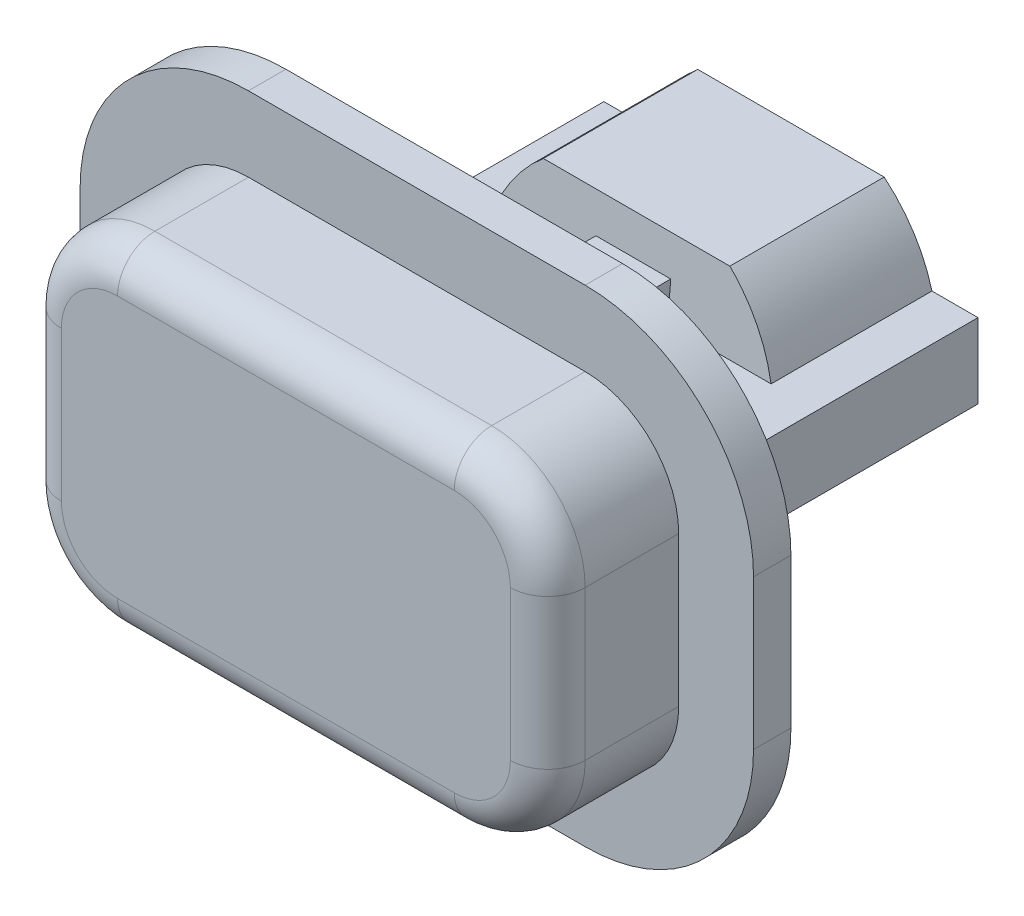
ISO-10303-21;
HEADER;
FILE_DESCRIPTION(('STEP AP214'),'2;1');
FILE_NAME('part.step','',(''),(''),'','','');
FILE_SCHEMA(('AUTOMOTIVE_DESIGN { 1 0 10303 214 1 1 1 1 }'));
ENDSEC;
DATA;
#1=APPLICATION_CONTEXT('core data for automotive mechanical design processes');
#2=APPLICATION_PROTOCOL_DEFINITION('international standard','automotive_design',2000,#1);
#3=PRODUCT_CONTEXT('',#1,'mechanical');
#4=PRODUCT('Part','Part','',(#3));
#5=PRODUCT_RELATED_PRODUCT_CATEGORY('part','',(#4));
#6=PRODUCT_DEFINITION_FORMATION('','',#4);
#7=PRODUCT_DEFINITION_CONTEXT('part definition',#1,'design');
#8=PRODUCT_DEFINITION('design','',#6,#7);
#9=PRODUCT_DEFINITION_SHAPE('','',#8);
#10=(LENGTH_UNIT() NAMED_UNIT(*) SI_UNIT(.MILLI.,.METRE.));
#11=(NAMED_UNIT(*) PLANE_ANGLE_UNIT() SI_UNIT($,.RADIAN.));
#12=(NAMED_UNIT(*) SI_UNIT($,.STERADIAN.) SOLID_ANGLE_UNIT());
#13=UNCERTAINTY_MEASURE_WITH_UNIT(LENGTH_MEASURE(1.E-05),#10,'distance_accuracy_value','');
#14=(GEOMETRIC_REPRESENTATION_CONTEXT(3) GLOBAL_UNCERTAINTY_ASSIGNED_CONTEXT((#13)) GLOBAL_UNIT_ASSIGNED_CONTEXT((#10,
#11,#12)) REPRESENTATION_CONTEXT('',''));
#15=CARTESIAN_POINT('',(0.,0.,0.));
#16=DIRECTION('',(0.,0.,1.));
#17=DIRECTION('',(1.,0.,0.));
#18=AXIS2_PLACEMENT_3D('',#15,#16,#17);
#19=CARTESIAN_POINT('',(0.,0.,-24.5308657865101));
#20=DIRECTION('',(0.,0.,1.));
#21=DIRECTION('',(1.,0.,0.));
#22=AXIS2_PLACEMENT_3D('',#19,#20,#21);
#23=CYLINDRICAL_SURFACE('',#22,3.9);
#24=CARTESIAN_POINT('',(0.,0.,-13.5));
#25=DIRECTION('',(0.,0.,-1.));
#26=DIRECTION('',(-1.,0.,0.));
#27=AXIS2_PLACEMENT_3D('',#24,#25,#26);
#28=CIRCLE('',#27,3.9);
#29=CARTESIAN_POINT('',(2.49198715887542,3.,-13.5));
#30=VERTEX_POINT('',#29);
#31=CARTESIAN_POINT('',(3.76961536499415,1.,-13.5));
#32=VERTEX_POINT('',#31);
#33=EDGE_CURVE('E401',#30,#32,#28,.T.);
#34=ORIENTED_EDGE('',*,*,#33,.F.);
#35=DIRECTION('',(0.,0.,1.));
#36=VECTOR('',#35,1.);
#37=CARTESIAN_POINT('',(2.49198715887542,3.,-24.5308657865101));
#38=LINE('',#37,#36);
#39=CARTESIAN_POINT('',(2.49198715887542,3.,-9.37497732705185));
#40=VERTEX_POINT('',#39);
#41=EDGE_CURVE('E561',#30,#40,#38,.T.);
#42=ORIENTED_EDGE('',*,*,#41,.T.);
#43=CARTESIAN_POINT('',(0.,0.,-9.11251133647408));
#44=DIRECTION('',(0.,0.0871557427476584,0.996194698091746));
#45=DIRECTION('',(0.,-0.996194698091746,0.0871557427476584));
#46=AXIS2_PLACEMENT_3D('',#43,#44,#45);
#47=ELLIPSE('',#46,3.91489736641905,3.9);
#48=CARTESIAN_POINT('',(3.76961536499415,1.,-9.2));
#49=VERTEX_POINT('',#48);
#50=EDGE_CURVE('E389',#40,#49,#47,.F.);
#51=ORIENTED_EDGE('',*,*,#50,.T.);
#52=DIRECTION('',(0.,0.,1.));
#53=VECTOR('',#52,1.);
#54=CARTESIAN_POINT('',(3.76961536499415,1.,-24.5308657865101));
#55=LINE('',#54,#53);
#56=EDGE_CURVE('E374',#49,#32,#55,.F.);
#57=ORIENTED_EDGE('',*,*,#56,.T.);
#58=EDGE_LOOP('',(#34,#42,#51,#57));
#59=FACE_BOUND('',#58,.T.);
#60=ADVANCED_FACE('F27',(#59),#23,.T.);
#61=CARTESIAN_POINT('',(5.,-1.,-13.5));
#62=DIRECTION('',(0.,1.,0.));
#63=DIRECTION('',(0.,0.,1.));
#64=AXIS2_PLACEMENT_3D('',#61,#62,#63);
#65=PLANE('',#64);
#66=DIRECTION('',(0.,0.,1.));
#67=VECTOR('',#66,1.);
#68=CARTESIAN_POINT('',(3.76961536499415,-1.,-24.5308657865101));
#69=LINE('',#68,#67);
#70=CARTESIAN_POINT('',(3.76961536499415,-1.,-13.5));
#71=VERTEX_POINT('',#70);
#72=CARTESIAN_POINT('',(3.76961536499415,-1.,-9.2));
#73=VERTEX_POINT('',#72);
#74=EDGE_CURVE('E132',#71,#73,#69,.T.);
#75=ORIENTED_EDGE('',*,*,#74,.F.);
#76=DIRECTION('',(-1.,0.,0.));
#77=VECTOR('',#76,1.);
#78=CARTESIAN_POINT('',(5.,-1.,-13.5));
#79=LINE('',#78,#77);
#80=CARTESIAN_POINT('',(5.,-1.,-13.5));
#81=VERTEX_POINT('',#80);
#82=EDGE_CURVE('E160',#81,#71,#79,.T.);
#83=ORIENTED_EDGE('',*,*,#82,.F.);
#84=DIRECTION('',(0.,0.,1.));
#85=VECTOR('',#84,1.);
#86=CARTESIAN_POINT('',(5.,-1.,-13.5));
#87=LINE('',#86,#85);
#88=CARTESIAN_POINT('',(5.,-1.,-4.5));
#89=VERTEX_POINT('',#88);
#90=EDGE_CURVE('E179',#81,#89,#87,.T.);
#91=ORIENTED_EDGE('',*,*,#90,.T.);
#92=DIRECTION('',(-1.,0.,0.));
#93=VECTOR('',#92,1.);
#94=CARTESIAN_POINT('',(5.,-1.,-4.5));
#95=LINE('',#94,#93);
#96=CARTESIAN_POINT('',(1.,-1.,-4.5));
#97=VERTEX_POINT('',#96);
#98=EDGE_CURVE('E50',#89,#97,#95,.T.);
#99=ORIENTED_EDGE('',*,*,#98,.T.);
#100=DIRECTION('',(0.,0.,1.));
#101=VECTOR('',#100,1.);
#102=CARTESIAN_POINT('',(1.,-1.,-13.5));
#103=LINE('',#102,#101);
#104=CARTESIAN_POINT('',(1.,-1.,-9.2));
#105=VERTEX_POINT('',#104);
#106=EDGE_CURVE('E142',#105,#97,#103,.T.);
#107=ORIENTED_EDGE('',*,*,#106,.F.);
#108=DIRECTION('',(-1.,0.,0.));
#109=VECTOR('',#108,1.);
#110=CARTESIAN_POINT('',(5.,-1.,-9.2));
#111=LINE('',#110,#109);
#112=EDGE_CURVE('E93',#73,#105,#111,.T.);
#113=ORIENTED_EDGE('',*,*,#112,.F.);
#114=EDGE_LOOP('',(#75,#83,#91,#99,#107,#113));
#115=FACE_BOUND('',#114,.T.);
#116=ADVANCED_FACE('F597',(#115),#65,.F.);
#117=DIRECTION('',(0.,0.,1.));
#118=VECTOR('',#117,1.);
#119=CARTESIAN_POINT('',(-3.76961536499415,-1.,-24.5308657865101));
#120=LINE('',#119,#118);
#121=CARTESIAN_POINT('',(-3.76961536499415,-1.,-9.2));
#122=VERTEX_POINT('',#121);
#123=CARTESIAN_POINT('',(-3.76961536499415,-1.,-13.5));
#124=VERTEX_POINT('',#123);
#125=EDGE_CURVE('E390',#122,#124,#120,.F.);
#126=ORIENTED_EDGE('',*,*,#125,.F.);
#127=DIRECTION('',(1.,0.,0.));
#128=VECTOR('',#127,1.);
#129=CARTESIAN_POINT('',(5.,-1.,-9.2));
#130=LINE('',#129,#128);
#131=CARTESIAN_POINT('',(-1.,-1.,-9.2));
#132=VERTEX_POINT('',#131);
#133=EDGE_CURVE('E98',#132,#122,#130,.F.);
#134=ORIENTED_EDGE('',*,*,#133,.F.);
#135=DIRECTION('',(0.,0.,-1.));
#136=VECTOR('',#135,1.);
#137=CARTESIAN_POINT('',(-1.,-1.,-13.5));
#138=LINE('',#137,#136);
#139=CARTESIAN_POINT('',(-1.,-1.,-4.5));
#140=VERTEX_POINT('',#139);
#141=EDGE_CURVE('E136',#140,#132,#138,.T.);
#142=ORIENTED_EDGE('',*,*,#141,.F.);
#143=CARTESIAN_POINT('',(-5.,-1.,-4.5));
#144=VERTEX_POINT('',#143);
#145=EDGE_CURVE('E147',#140,#144,#95,.T.);
#146=ORIENTED_EDGE('',*,*,#145,.T.);
#147=DIRECTION('',(0.,0.,1.));
#148=VECTOR('',#147,1.);
#149=CARTESIAN_POINT('',(-5.,-1.,-13.5));
#150=LINE('',#149,#148);
#151=CARTESIAN_POINT('',(-5.,-1.,-13.5));
#152=VERTEX_POINT('',#151);
#153=EDGE_CURVE('E176',#152,#144,#150,.T.);
#154=ORIENTED_EDGE('',*,*,#153,.F.);
#155=EDGE_CURVE('E159',#124,#152,#79,.T.);
#156=ORIENTED_EDGE('',*,*,#155,.F.);
#157=EDGE_LOOP('',(#126,#134,#142,#146,#154,#156));
#158=FACE_BOUND('',#157,.T.);
#159=ADVANCED_FACE('F426',(#158),#65,.F.);
#160=CARTESIAN_POINT('',(5.,0.999999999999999,-13.5));
#161=DIRECTION('',(0.,-1.,0.));
#162=DIRECTION('',(1.,0.,0.));
#163=AXIS2_PLACEMENT_3D('',#160,#161,#162);
#164=PLANE('',#163);
#165=ORIENTED_EDGE('',*,*,#56,.F.);
#166=DIRECTION('',(1.,0.,0.));
#167=VECTOR('',#166,1.);
#168=CARTESIAN_POINT('',(5.,0.999999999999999,-9.2));
#169=LINE('',#168,#167);
#170=CARTESIAN_POINT('',(1.,1.,-9.2));
#171=VERTEX_POINT('',#170);
#172=EDGE_CURVE('E375',#171,#49,#169,.T.);
#173=ORIENTED_EDGE('',*,*,#172,.F.);
#174=DIRECTION('',(0.,0.,-1.));
#175=VECTOR('',#174,1.);
#176=CARTESIAN_POINT('',(1.,1.,-13.5));
#177=LINE('',#176,#175);
#178=CARTESIAN_POINT('',(1.,1.,-4.5));
#179=VERTEX_POINT('',#178);
#180=EDGE_CURVE('E139',#179,#171,#177,.T.);
#181=ORIENTED_EDGE('',*,*,#180,.F.);
#182=DIRECTION('',(1.,0.,0.));
#183=VECTOR('',#182,1.);
#184=CARTESIAN_POINT('',(5.,0.999999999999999,-4.5));
#185=LINE('',#184,#183);
#186=CARTESIAN_POINT('',(5.,0.999999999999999,-4.5));
#187=VERTEX_POINT('',#186);
#188=EDGE_CURVE('E152',#179,#187,#185,.T.);
#189=ORIENTED_EDGE('',*,*,#188,.T.);
#190=DIRECTION('',(0.,0.,1.));
#191=VECTOR('',#190,1.);
#192=CARTESIAN_POINT('',(5.,0.999999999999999,-13.5));
#193=LINE('',#192,#191);
#194=CARTESIAN_POINT('',(5.,0.999999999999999,-13.5));
#195=VERTEX_POINT('',#194);
#196=EDGE_CURVE('E170',#195,#187,#193,.T.);
#197=ORIENTED_EDGE('',*,*,#196,.F.);
#198=DIRECTION('',(1.,0.,0.));
#199=VECTOR('',#198,1.);
#200=CARTESIAN_POINT('',(5.,0.999999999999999,-13.5));
#201=LINE('',#200,#199);
#202=EDGE_CURVE('E166',#32,#195,#201,.T.);
#203=ORIENTED_EDGE('',*,*,#202,.F.);
#204=EDGE_LOOP('',(#165,#173,#181,#189,#197,#203));
#205=FACE_BOUND('',#204,.T.);
#206=ADVANCED_FACE('F643',(#205),#164,.F.);
#207=DIRECTION('',(0.,0.,1.));
#208=VECTOR('',#207,1.);
#209=CARTESIAN_POINT('',(-3.76961536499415,1.,-24.5308657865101));
#210=LINE('',#209,#208);
#211=CARTESIAN_POINT('',(-3.76961536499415,1.,-13.5));
#212=VERTEX_POINT('',#211);
#213=CARTESIAN_POINT('',(-3.76961536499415,1.,-9.2));
#214=VERTEX_POINT('',#213);
#215=EDGE_CURVE('E372',#212,#214,#210,.T.);
#216=ORIENTED_EDGE('',*,*,#215,.F.);
#217=CARTESIAN_POINT('',(-5.,1.,-13.5));
#218=VERTEX_POINT('',#217);
#219=EDGE_CURVE('E167',#218,#212,#201,.T.);
#220=ORIENTED_EDGE('',*,*,#219,.F.);
#221=DIRECTION('',(0.,0.,1.));
#222=VECTOR('',#221,1.);
#223=CARTESIAN_POINT('',(-5.,1.,-13.5));
#224=LINE('',#223,#222);
#225=CARTESIAN_POINT('',(-5.,1.,-4.5));
#226=VERTEX_POINT('',#225);
#227=EDGE_CURVE('E173',#218,#226,#224,.T.);
#228=ORIENTED_EDGE('',*,*,#227,.T.);
#229=CARTESIAN_POINT('',(-1.,1.,-4.5));
#230=VERTEX_POINT('',#229);
#231=EDGE_CURVE('E153',#226,#230,#185,.T.);
#232=ORIENTED_EDGE('',*,*,#231,.T.);
#233=DIRECTION('',(0.,0.,1.));
#234=VECTOR('',#233,1.);
#235=CARTESIAN_POINT('',(-1.,1.,-13.5));
#236=LINE('',#235,#234);
#237=CARTESIAN_POINT('',(-1.,1.,-9.2));
#238=VERTEX_POINT('',#237);
#239=EDGE_CURVE('E133',#238,#230,#236,.T.);
#240=ORIENTED_EDGE('',*,*,#239,.F.);
#241=DIRECTION('',(-1.,0.,0.));
#242=VECTOR('',#241,1.);
#243=CARTESIAN_POINT('',(5.,0.999999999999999,-9.2));
#244=LINE('',#243,#242);
#245=EDGE_CURVE('E383',#214,#238,#244,.F.);
#246=ORIENTED_EDGE('',*,*,#245,.F.);
#247=EDGE_LOOP('',(#216,#220,#228,#232,#240,#246));
#248=FACE_BOUND('',#247,.T.);
#249=ADVANCED_FACE('F543',(#248),#164,.F.);
#250=CARTESIAN_POINT('',(-1.,2.,-17.9721359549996));
#251=DIRECTION('',(1.,0.,0.));
#252=DIRECTION('',(0.,0.,-1.));
#253=AXIS2_PLACEMENT_3D('',#250,#251,#252);
#254=PLANE('',#253);
#255=DIRECTION('',(0.,-0.996194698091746,0.0871557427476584));
#256=VECTOR('',#255,1.);
#257=CARTESIAN_POINT('',(-1.,2.75403658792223,-9.35345831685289));
#258=LINE('',#257,#256);
#259=CARTESIAN_POINT('',(-1.,2.,-9.28748866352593));
#260=VERTEX_POINT('',#259);
#261=EDGE_CURVE('E379',#238,#260,#258,.F.);
#262=ORIENTED_EDGE('',*,*,#261,.F.);
#263=ORIENTED_EDGE('',*,*,#239,.T.);
#264=DIRECTION('',(0.,1.,0.));
#265=VECTOR('',#264,1.);
#266=CARTESIAN_POINT('',(-1.,2.,-4.5));
#267=LINE('',#266,#265);
#268=CARTESIAN_POINT('',(-1.,2.,-4.5));
#269=VERTEX_POINT('',#268);
#270=EDGE_CURVE('E123',#230,#269,#267,.T.);
#271=ORIENTED_EDGE('',*,*,#270,.T.);
#272=DIRECTION('',(0.,0.,1.));
#273=VECTOR('',#272,1.);
#274=CARTESIAN_POINT('',(-1.,2.,-17.9721359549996));
#275=LINE('',#274,#273);
#276=EDGE_CURVE('E124',#260,#269,#275,.T.);
#277=ORIENTED_EDGE('',*,*,#276,.F.);
#278=EDGE_LOOP('',(#262,#263,#271,#277));
#279=FACE_BOUND('',#278,.T.);
#280=ADVANCED_FACE('F629',(#279),#254,.F.);
#281=CARTESIAN_POINT('',(1.,2.,-17.9721359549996));
#282=DIRECTION('',(-1.,0.,0.));
#283=DIRECTION('',(0.,0.,1.));
#284=AXIS2_PLACEMENT_3D('',#281,#282,#283);
#285=PLANE('',#284);
#286=DIRECTION('',(0.,0.996194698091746,-0.0871557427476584));
#287=VECTOR('',#286,1.);
#288=CARTESIAN_POINT('',(1.,2.75403658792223,-9.35345831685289));
#289=LINE('',#288,#287);
#290=CARTESIAN_POINT('',(1.,2.,-9.28748866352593));
#291=VERTEX_POINT('',#290);
#292=EDGE_CURVE('E376',#291,#171,#289,.F.);
#293=ORIENTED_EDGE('',*,*,#292,.F.);
#294=DIRECTION('',(0.,0.,1.));
#295=VECTOR('',#294,1.);
#296=CARTESIAN_POINT('',(1.,2.,-17.9721359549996));
#297=LINE('',#296,#295);
#298=CARTESIAN_POINT('',(1.,2.,-4.5));
#299=VERTEX_POINT('',#298);
#300=EDGE_CURVE('E129',#291,#299,#297,.T.);
#301=ORIENTED_EDGE('',*,*,#300,.T.);
#302=DIRECTION('',(0.,-1.,0.));
#303=VECTOR('',#302,1.);
#304=CARTESIAN_POINT('',(1.,2.,-4.5));
#305=LINE('',#304,#303);
#306=EDGE_CURVE('E116',#299,#179,#305,.T.);
#307=ORIENTED_EDGE('',*,*,#306,.T.);
#308=ORIENTED_EDGE('',*,*,#180,.T.);
#309=EDGE_LOOP('',(#293,#301,#307,#308));
#310=FACE_BOUND('',#309,.T.);
#311=ADVANCED_FACE('F636',(#310),#285,.F.);
#312=CARTESIAN_POINT('',(1.,2.,-17.9721359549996));
#313=DIRECTION('',(0.,-1.,0.));
#314=DIRECTION('',(0.,0.,-1.));
#315=AXIS2_PLACEMENT_3D('',#312,#313,#314);
#316=PLANE('',#315);
#317=DIRECTION('',(-1.,0.,0.));
#318=VECTOR('',#317,1.);
#319=CARTESIAN_POINT('',(1.,2.,-9.28748866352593));
#320=LINE('',#319,#318);
#321=EDGE_CURVE('E380',#260,#291,#320,.F.);
#322=ORIENTED_EDGE('',*,*,#321,.F.);
#323=ORIENTED_EDGE('',*,*,#276,.T.);
#324=DIRECTION('',(1.,0.,0.));
#325=VECTOR('',#324,1.);
#326=CARTESIAN_POINT('',(1.,2.,-4.5));
#327=LINE('',#326,#325);
#328=EDGE_CURVE('E127',#269,#299,#327,.T.);
#329=ORIENTED_EDGE('',*,*,#328,.T.);
#330=ORIENTED_EDGE('',*,*,#300,.F.);
#331=EDGE_LOOP('',(#322,#323,#329,#330));
#332=FACE_BOUND('',#331,.T.);
#333=ADVANCED_FACE('F635',(#332),#316,.F.);
#334=DIRECTION('',(0.,0.996194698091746,0.0871557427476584));
#335=VECTOR('',#334,1.);
#336=CARTESIAN_POINT('',(1.,1.2155789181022,-9.00616196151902));
#337=LINE('',#336,#335);
#338=CARTESIAN_POINT('',(1.,-2.,-9.28748866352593));
#339=VERTEX_POINT('',#338);
#340=EDGE_CURVE('E88',#105,#339,#337,.F.);
#341=ORIENTED_EDGE('',*,*,#340,.F.);
#342=ORIENTED_EDGE('',*,*,#106,.T.);
#343=CARTESIAN_POINT('',(1.,-2.,-4.5));
#344=VERTEX_POINT('',#343);
#345=EDGE_CURVE('E113',#97,#344,#305,.T.);
#346=ORIENTED_EDGE('',*,*,#345,.T.);
#347=DIRECTION('',(0.,0.,1.));
#348=VECTOR('',#347,1.);
#349=CARTESIAN_POINT('',(1.,-2.,-17.9721359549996));
#350=LINE('',#349,#348);
#351=EDGE_CURVE('E106',#339,#344,#350,.T.);
#352=ORIENTED_EDGE('',*,*,#351,.F.);
#353=EDGE_LOOP('',(#341,#342,#346,#352));
#354=FACE_BOUND('',#353,.T.);
#355=ADVANCED_FACE('F112',(#354),#285,.F.);
#356=DIRECTION('',(0.,-0.996194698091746,-0.0871557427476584));
#357=VECTOR('',#356,1.);
#358=CARTESIAN_POINT('',(-1.,1.2155789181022,-9.00616196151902));
#359=LINE('',#358,#357);
#360=CARTESIAN_POINT('',(-1.,-2.,-9.28748866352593));
#361=VERTEX_POINT('',#360);
#362=EDGE_CURVE('E99',#361,#132,#359,.F.);
#363=ORIENTED_EDGE('',*,*,#362,.F.);
#364=DIRECTION('',(0.,0.,1.));
#365=VECTOR('',#364,1.);
#366=CARTESIAN_POINT('',(-1.,-2.,-17.9721359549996));
#367=LINE('',#366,#365);
#368=CARTESIAN_POINT('',(-1.,-2.,-4.5));
#369=VERTEX_POINT('',#368);
#370=EDGE_CURVE('E109',#361,#369,#367,.T.);
#371=ORIENTED_EDGE('',*,*,#370,.T.);
#372=EDGE_CURVE('E128',#369,#140,#267,.T.);
#373=ORIENTED_EDGE('',*,*,#372,.T.);
#374=ORIENTED_EDGE('',*,*,#141,.T.);
#375=EDGE_LOOP('',(#363,#371,#373,#374));
#376=FACE_BOUND('',#375,.T.);
#377=ADVANCED_FACE('F619',(#376),#254,.F.);
#378=CARTESIAN_POINT('',(1.,-2.,-17.9721359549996));
#379=DIRECTION('',(0.,1.,0.));
#380=DIRECTION('',(0.,0.,1.));
#381=AXIS2_PLACEMENT_3D('',#378,#379,#380);
#382=PLANE('',#381);
#383=DIRECTION('',(1.,0.,0.));
#384=VECTOR('',#383,1.);
#385=CARTESIAN_POINT('',(1.,-2.,-9.28748866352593));
#386=LINE('',#385,#384);
#387=EDGE_CURVE('E35',#339,#361,#386,.F.);
#388=ORIENTED_EDGE('',*,*,#387,.F.);
#389=ORIENTED_EDGE('',*,*,#351,.T.);
#390=DIRECTION('',(-1.,0.,0.));
#391=VECTOR('',#390,1.);
#392=CARTESIAN_POINT('',(1.,-2.,-4.5));
#393=LINE('',#392,#391);
#394=EDGE_CURVE('E115',#344,#369,#393,.T.);
#395=ORIENTED_EDGE('',*,*,#394,.T.);
#396=ORIENTED_EDGE('',*,*,#370,.F.);
#397=EDGE_LOOP('',(#388,#389,#395,#396));
#398=FACE_BOUND('',#397,.T.);
#399=ADVANCED_FACE('F103',(#398),#382,.F.);
#400=CARTESIAN_POINT('',(-4.5,1.99999999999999,-4.5));
#401=DIRECTION('',(0.,0.,1.));
#402=DIRECTION('',(1.,0.,0.));
#403=AXIS2_PLACEMENT_3D('',#400,#401,#402);
#404=PLANE('',#403);
#405=CARTESIAN_POINT('',(-4.5,1.99999999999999,-4.5));
#406=DIRECTION('',(0.,0.,-1.));
#407=DIRECTION('',(1.,0.,0.));
#408=AXIS2_PLACEMENT_3D('',#405,#406,#407);
#409=CIRCLE('',#408,4.50000000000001);
#410=CARTESIAN_POINT('',(-9.00000000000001,1.99999999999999,-4.5));
#411=VERTEX_POINT('',#410);
#412=CARTESIAN_POINT('',(-4.5,6.5,-4.5));
#413=VERTEX_POINT('',#412);
#414=EDGE_CURVE('E229',#411,#413,#409,.T.);
#415=ORIENTED_EDGE('',*,*,#414,.T.);
#416=DIRECTION('',(1.,0.,0.));
#417=VECTOR('',#416,1.);
#418=CARTESIAN_POINT('',(-4.5,6.5,-4.5));
#419=LINE('',#418,#417);
#420=CARTESIAN_POINT('',(4.5,6.5,-4.5));
#421=VERTEX_POINT('',#420);
#422=EDGE_CURVE('E232',#413,#421,#419,.T.);
#423=ORIENTED_EDGE('',*,*,#422,.T.);
#424=CARTESIAN_POINT('',(4.5,1.99999999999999,-4.5));
#425=DIRECTION('',(0.,0.,-1.));
#426=DIRECTION('',(1.,0.,0.));
#427=AXIS2_PLACEMENT_3D('',#424,#425,#426);
#428=CIRCLE('',#427,4.50000000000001);
#429=CARTESIAN_POINT('',(9.00000000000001,1.99999999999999,-4.5));
#430=VERTEX_POINT('',#429);
#431=EDGE_CURVE('E235',#421,#430,#428,.T.);
#432=ORIENTED_EDGE('',*,*,#431,.T.);
#433=DIRECTION('',(0.,-1.,0.));
#434=VECTOR('',#433,1.);
#435=CARTESIAN_POINT('',(9.00000000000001,1.99999999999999,-4.5));
#436=LINE('',#435,#434);
#437=CARTESIAN_POINT('',(9.00000000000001,-1.99999999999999,-4.5));
#438=VERTEX_POINT('',#437);
#439=EDGE_CURVE('E238',#430,#438,#436,.T.);
#440=ORIENTED_EDGE('',*,*,#439,.T.);
#441=CARTESIAN_POINT('',(4.5,-1.99999999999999,-4.5));
#442=DIRECTION('',(0.,0.,-1.));
#443=DIRECTION('',(-1.,0.,0.));
#444=AXIS2_PLACEMENT_3D('',#441,#442,#443);
#445=CIRCLE('',#444,4.50000000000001);
#446=CARTESIAN_POINT('',(4.5,-6.5,-4.5));
#447=VERTEX_POINT('',#446);
#448=EDGE_CURVE('E241',#438,#447,#445,.T.);
#449=ORIENTED_EDGE('',*,*,#448,.T.);
#450=DIRECTION('',(-1.,0.,0.));
#451=VECTOR('',#450,1.);
#452=CARTESIAN_POINT('',(-4.5,-6.5,-4.5));
#453=LINE('',#452,#451);
#454=CARTESIAN_POINT('',(-4.5,-6.5,-4.5));
#455=VERTEX_POINT('',#454);
#456=EDGE_CURVE('E244',#447,#455,#453,.T.);
#457=ORIENTED_EDGE('',*,*,#456,.T.);
#458=CARTESIAN_POINT('',(-4.5,-1.99999999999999,-4.5));
#459=DIRECTION('',(0.,0.,-1.));
#460=DIRECTION('',(1.,0.,0.));
#461=AXIS2_PLACEMENT_3D('',#458,#459,#460);
#462=CIRCLE('',#461,4.50000000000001);
#463=CARTESIAN_POINT('',(-9.00000000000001,-1.99999999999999,-4.5));
#464=VERTEX_POINT('',#463);
#465=EDGE_CURVE('E247',#455,#464,#462,.T.);
#466=ORIENTED_EDGE('',*,*,#465,.T.);
#467=DIRECTION('',(0.,1.,0.));
#468=VECTOR('',#467,1.);
#469=CARTESIAN_POINT('',(-9.00000000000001,1.99999999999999,-4.5));
#470=LINE('',#469,#468);
#471=EDGE_CURVE('E250',#464,#411,#470,.T.);
#472=ORIENTED_EDGE('',*,*,#471,.T.);
#473=EDGE_LOOP('',(#415,#423,#432,#440,#449,#457,#466,#472));
#474=FACE_BOUND('',#473,.T.);
#475=ORIENTED_EDGE('',*,*,#345,.F.);
#476=ORIENTED_EDGE('',*,*,#98,.F.);
#477=DIRECTION('',(0.,-1.,0.));
#478=VECTOR('',#477,1.);
#479=CARTESIAN_POINT('',(5.,0.999999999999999,-4.5));
#480=LINE('',#479,#478);
#481=EDGE_CURVE('E144',#187,#89,#480,.T.);
#482=ORIENTED_EDGE('',*,*,#481,.F.);
#483=ORIENTED_EDGE('',*,*,#188,.F.);
#484=ORIENTED_EDGE('',*,*,#306,.F.);
#485=ORIENTED_EDGE('',*,*,#328,.F.);
#486=ORIENTED_EDGE('',*,*,#270,.F.);
#487=ORIENTED_EDGE('',*,*,#231,.F.);
#488=DIRECTION('',(0.,1.,0.));
#489=VECTOR('',#488,1.);
#490=CARTESIAN_POINT('',(-5.,1.,-4.5));
#491=LINE('',#490,#489);
#492=EDGE_CURVE('E149',#144,#226,#491,.T.);
#493=ORIENTED_EDGE('',*,*,#492,.F.);
#494=ORIENTED_EDGE('',*,*,#145,.F.);
#495=ORIENTED_EDGE('',*,*,#372,.F.);
#496=ORIENTED_EDGE('',*,*,#394,.F.);
#497=EDGE_LOOP('',(#475,#476,#482,#483,#484,#485,#486,#487,#493,#494,#495,#496));
#498=FACE_BOUND('',#497,.T.);
#499=ADVANCED_FACE('F536',(#474,#498),#404,.F.);
#500=CARTESIAN_POINT('',(-4.5,-2.,-3.5));
#501=DIRECTION('',(0.,0.,1.));
#502=DIRECTION('',(1.,0.,0.));
#503=AXIS2_PLACEMENT_3D('',#500,#501,#502);
#504=CYLINDRICAL_SURFACE('',#503,2.5);
#505=DIRECTION('',(0.,0.,1.));
#506=VECTOR('',#505,1.);
#507=CARTESIAN_POINT('',(-4.5,-4.5,-3.5));
#508=LINE('',#507,#506);
#509=CARTESIAN_POINT('',(-4.5,-4.5,-3.5));
#510=VERTEX_POINT('',#509);
#511=CARTESIAN_POINT('',(-4.5,-4.5,-1.));
#512=VERTEX_POINT('',#511);
#513=EDGE_CURVE('E301',#510,#512,#508,.T.);
#514=ORIENTED_EDGE('',*,*,#513,.T.);
#515=CARTESIAN_POINT('',(-4.5,-2.,-1.));
#516=DIRECTION('',(0.,0.,1.));
#517=DIRECTION('',(1.,0.,0.));
#518=AXIS2_PLACEMENT_3D('',#515,#516,#517);
#519=CIRCLE('',#518,2.5);
#520=CARTESIAN_POINT('',(-7.,-2.,-1.));
#521=VERTEX_POINT('',#520);
#522=EDGE_CURVE('E361',#512,#521,#519,.F.);
#523=ORIENTED_EDGE('',*,*,#522,.T.);
#524=DIRECTION('',(0.,0.,1.));
#525=VECTOR('',#524,1.);
#526=CARTESIAN_POINT('',(-7.,-2.,-3.5));
#527=LINE('',#526,#525);
#528=CARTESIAN_POINT('',(-7.,-2.,-3.5));
#529=VERTEX_POINT('',#528);
#530=EDGE_CURVE('E302',#529,#521,#527,.T.);
#531=ORIENTED_EDGE('',*,*,#530,.F.);
#532=CARTESIAN_POINT('',(-4.5,-2.,-3.5));
#533=DIRECTION('',(0.,0.,1.));
#534=DIRECTION('',(1.,0.,0.));
#535=AXIS2_PLACEMENT_3D('',#532,#533,#534);
#536=CIRCLE('',#535,2.5);
#537=EDGE_CURVE('E277',#529,#510,#536,.T.);
#538=ORIENTED_EDGE('',*,*,#537,.T.);
#539=EDGE_LOOP('',(#514,#523,#531,#538));
#540=FACE_BOUND('',#539,.T.);
#541=ADVANCED_FACE('F829',(#540),#504,.T.);
#542=CARTESIAN_POINT('',(-7.00000000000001,2.,-3.5));
#543=DIRECTION('',(-1.,0.,0.));
#544=DIRECTION('',(0.,-1.,0.));
#545=AXIS2_PLACEMENT_3D('',#542,#543,#544);
#546=PLANE('',#545);
#547=ORIENTED_EDGE('',*,*,#530,.T.);
#548=DIRECTION('',(0.,-1.,0.));
#549=VECTOR('',#548,1.);
#550=CARTESIAN_POINT('',(-7.00000000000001,2.,-1.));
#551=LINE('',#550,#549);
#552=CARTESIAN_POINT('',(-7.00000000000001,2.,-1.));
#553=VERTEX_POINT('',#552);
#554=EDGE_CURVE('E364',#521,#553,#551,.F.);
#555=ORIENTED_EDGE('',*,*,#554,.T.);
#556=DIRECTION('',(0.,0.,1.));
#557=VECTOR('',#556,1.);
#558=CARTESIAN_POINT('',(-7.00000000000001,2.,-3.5));
#559=LINE('',#558,#557);
#560=CARTESIAN_POINT('',(-7.,2.,-3.5));
#561=VERTEX_POINT('',#560);
#562=EDGE_CURVE('E306',#561,#553,#559,.T.);
#563=ORIENTED_EDGE('',*,*,#562,.F.);
#564=DIRECTION('',(0.,-1.,0.));
#565=VECTOR('',#564,1.);
#566=CARTESIAN_POINT('',(-7.00000000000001,2.,-3.5));
#567=LINE('',#566,#565);
#568=EDGE_CURVE('E298',#561,#529,#567,.T.);
#569=ORIENTED_EDGE('',*,*,#568,.T.);
#570=EDGE_LOOP('',(#547,#555,#563,#569));
#571=FACE_BOUND('',#570,.T.);
#572=ADVANCED_FACE('F821',(#571),#546,.T.);
#573=CARTESIAN_POINT('',(-4.5,2.,-3.5));
#574=DIRECTION('',(0.,0.,1.));
#575=DIRECTION('',(1.,0.,0.));
#576=AXIS2_PLACEMENT_3D('',#573,#574,#575);
#577=CYLINDRICAL_SURFACE('',#576,2.5);
#578=ORIENTED_EDGE('',*,*,#562,.T.);
#579=CARTESIAN_POINT('',(-4.5,2.,-1.));
#580=DIRECTION('',(0.,0.,1.));
#581=DIRECTION('',(1.,0.,0.));
#582=AXIS2_PLACEMENT_3D('',#579,#580,#581);
#583=CIRCLE('',#582,2.5);
#584=CARTESIAN_POINT('',(-4.5,4.5,-1.));
#585=VERTEX_POINT('',#584);
#586=EDGE_CURVE('E367',#553,#585,#583,.F.);
#587=ORIENTED_EDGE('',*,*,#586,.T.);
#588=DIRECTION('',(0.,0.,1.));
#589=VECTOR('',#588,1.);
#590=CARTESIAN_POINT('',(-4.5,4.5,-3.5));
#591=LINE('',#590,#589);
#592=CARTESIAN_POINT('',(-4.5,4.5,-3.5));
#593=VERTEX_POINT('',#592);
#594=EDGE_CURVE('E309',#593,#585,#591,.T.);
#595=ORIENTED_EDGE('',*,*,#594,.F.);
#596=CARTESIAN_POINT('',(-4.5,2.,-3.5));
#597=DIRECTION('',(0.,0.,1.));
#598=DIRECTION('',(1.,0.,0.));
#599=AXIS2_PLACEMENT_3D('',#596,#597,#598);
#600=CIRCLE('',#599,2.5);
#601=EDGE_CURVE('E295',#593,#561,#600,.T.);
#602=ORIENTED_EDGE('',*,*,#601,.T.);
#603=EDGE_LOOP('',(#578,#587,#595,#602));
#604=FACE_BOUND('',#603,.T.);
#605=ADVANCED_FACE('F813',(#604),#577,.T.);
#606=CARTESIAN_POINT('',(-4.5,4.5,-3.5));
#607=DIRECTION('',(0.,1.,0.));
#608=DIRECTION('',(-1.,0.,0.));
#609=AXIS2_PLACEMENT_3D('',#606,#607,#608);
#610=PLANE('',#609);
#611=ORIENTED_EDGE('',*,*,#594,.T.);
#612=DIRECTION('',(-1.,0.,0.));
#613=VECTOR('',#612,1.);
#614=CARTESIAN_POINT('',(-4.5,4.5,-1.));
#615=LINE('',#614,#613);
#616=CARTESIAN_POINT('',(4.5,4.5,-1.));
#617=VERTEX_POINT('',#616);
#618=EDGE_CURVE('E110',#585,#617,#615,.F.);
#619=ORIENTED_EDGE('',*,*,#618,.T.);
#620=DIRECTION('',(0.,0.,1.));
#621=VECTOR('',#620,1.);
#622=CARTESIAN_POINT('',(4.5,4.5,-3.5));
#623=LINE('',#622,#621);
#624=CARTESIAN_POINT('',(4.5,4.5,-3.5));
#625=VERTEX_POINT('',#624);
#626=EDGE_CURVE('E312',#625,#617,#623,.T.);
#627=ORIENTED_EDGE('',*,*,#626,.F.);
#628=DIRECTION('',(-1.,0.,0.));
#629=VECTOR('',#628,1.);
#630=CARTESIAN_POINT('',(-4.5,4.5,-3.5));
#631=LINE('',#630,#629);
#632=EDGE_CURVE('E292',#625,#593,#631,.T.);
#633=ORIENTED_EDGE('',*,*,#632,.T.);
#634=EDGE_LOOP('',(#611,#619,#627,#633));
#635=FACE_BOUND('',#634,.T.);
#636=ADVANCED_FACE('F805',(#635),#610,.T.);
#637=CARTESIAN_POINT('',(4.5,2.,-3.5));
#638=DIRECTION('',(0.,0.,1.));
#639=DIRECTION('',(1.,0.,0.));
#640=AXIS2_PLACEMENT_3D('',#637,#638,#639);
#641=CYLINDRICAL_SURFACE('',#640,2.5);
#642=ORIENTED_EDGE('',*,*,#626,.T.);
#643=CARTESIAN_POINT('',(4.5,2.,-1.));
#644=DIRECTION('',(0.,0.,1.));
#645=DIRECTION('',(1.,0.,0.));
#646=AXIS2_PLACEMENT_3D('',#643,#644,#645);
#647=CIRCLE('',#646,2.5);
#648=CARTESIAN_POINT('',(7.,2.,-1.));
#649=VERTEX_POINT('',#648);
#650=EDGE_CURVE('E349',#617,#649,#647,.F.);
#651=ORIENTED_EDGE('',*,*,#650,.T.);
#652=DIRECTION('',(0.,0.,1.));
#653=VECTOR('',#652,1.);
#654=CARTESIAN_POINT('',(7.,2.,-3.5));
#655=LINE('',#654,#653);
#656=CARTESIAN_POINT('',(7.00000000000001,2.,-3.5));
#657=VERTEX_POINT('',#656);
#658=EDGE_CURVE('E315',#657,#649,#655,.T.);
#659=ORIENTED_EDGE('',*,*,#658,.F.);
#660=CARTESIAN_POINT('',(4.5,2.,-3.5));
#661=DIRECTION('',(0.,0.,1.));
#662=DIRECTION('',(1.,0.,0.));
#663=AXIS2_PLACEMENT_3D('',#660,#661,#662);
#664=CIRCLE('',#663,2.5);
#665=EDGE_CURVE('E289',#657,#625,#664,.T.);
#666=ORIENTED_EDGE('',*,*,#665,.T.);
#667=EDGE_LOOP('',(#642,#651,#659,#666));
#668=FACE_BOUND('',#667,.T.);
#669=ADVANCED_FACE('F797',(#668),#641,.T.);
#670=CARTESIAN_POINT('',(7.00000000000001,2.,-3.5));
#671=DIRECTION('',(1.,0.,0.));
#672=DIRECTION('',(0.,1.,0.));
#673=AXIS2_PLACEMENT_3D('',#670,#671,#672);
#674=PLANE('',#673);
#675=ORIENTED_EDGE('',*,*,#658,.T.);
#676=DIRECTION('',(0.,1.,0.));
#677=VECTOR('',#676,1.);
#678=CARTESIAN_POINT('',(7.00000000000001,2.,-1.));
#679=LINE('',#678,#677);
#680=CARTESIAN_POINT('',(7.00000000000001,-2.,-1.));
#681=VERTEX_POINT('',#680);
#682=EDGE_CURVE('E352',#649,#681,#679,.F.);
#683=ORIENTED_EDGE('',*,*,#682,.T.);
#684=DIRECTION('',(0.,0.,1.));
#685=VECTOR('',#684,1.);
#686=CARTESIAN_POINT('',(7.00000000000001,-2.,-3.5));
#687=LINE('',#686,#685);
#688=CARTESIAN_POINT('',(7.00000000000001,-2.,-3.5));
#689=VERTEX_POINT('',#688);
#690=EDGE_CURVE('E318',#689,#681,#687,.T.);
#691=ORIENTED_EDGE('',*,*,#690,.F.);
#692=DIRECTION('',(0.,1.,0.));
#693=VECTOR('',#692,1.);
#694=CARTESIAN_POINT('',(7.00000000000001,2.,-3.5));
#695=LINE('',#694,#693);
#696=EDGE_CURVE('E286',#689,#657,#695,.T.);
#697=ORIENTED_EDGE('',*,*,#696,.T.);
#698=EDGE_LOOP('',(#675,#683,#691,#697));
#699=FACE_BOUND('',#698,.T.);
#700=ADVANCED_FACE('F789',(#699),#674,.T.);
#701=CARTESIAN_POINT('',(4.50000000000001,-2.,-3.5));
#702=DIRECTION('',(0.,0.,1.));
#703=DIRECTION('',(1.,0.,0.));
#704=AXIS2_PLACEMENT_3D('',#701,#702,#703);
#705=CYLINDRICAL_SURFACE('',#704,2.5);
#706=ORIENTED_EDGE('',*,*,#690,.T.);
#707=CARTESIAN_POINT('',(4.50000000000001,-2.,-1.));
#708=DIRECTION('',(0.,0.,1.));
#709=DIRECTION('',(1.,0.,0.));
#710=AXIS2_PLACEMENT_3D('',#707,#708,#709);
#711=CIRCLE('',#710,2.5);
#712=CARTESIAN_POINT('',(4.50000000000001,-4.5,-1.));
#713=VERTEX_POINT('',#712);
#714=EDGE_CURVE('E355',#681,#713,#711,.F.);
#715=ORIENTED_EDGE('',*,*,#714,.T.);
#716=DIRECTION('',(0.,0.,1.));
#717=VECTOR('',#716,1.);
#718=CARTESIAN_POINT('',(4.50000000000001,-4.5,-3.5));
#719=LINE('',#718,#717);
#720=CARTESIAN_POINT('',(4.50000000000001,-4.5,-3.5));
#721=VERTEX_POINT('',#720);
#722=EDGE_CURVE('E321',#721,#713,#719,.T.);
#723=ORIENTED_EDGE('',*,*,#722,.F.);
#724=CARTESIAN_POINT('',(4.50000000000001,-2.,-3.5));
#725=DIRECTION('',(0.,0.,1.));
#726=DIRECTION('',(-1.,0.,0.));
#727=AXIS2_PLACEMENT_3D('',#724,#725,#726);
#728=CIRCLE('',#727,2.5);
#729=EDGE_CURVE('E283',#721,#689,#728,.T.);
#730=ORIENTED_EDGE('',*,*,#729,.T.);
#731=EDGE_LOOP('',(#706,#715,#723,#730));
#732=FACE_BOUND('',#731,.T.);
#733=ADVANCED_FACE('F781',(#732),#705,.T.);
#734=CARTESIAN_POINT('',(-4.5,-4.5,-3.5));
#735=DIRECTION('',(0.,-1.,0.));
#736=DIRECTION('',(1.,0.,0.));
#737=AXIS2_PLACEMENT_3D('',#734,#735,#736);
#738=PLANE('',#737);
#739=ORIENTED_EDGE('',*,*,#722,.T.);
#740=DIRECTION('',(1.,0.,0.));
#741=VECTOR('',#740,1.);
#742=CARTESIAN_POINT('',(-4.5,-4.5,-1.));
#743=LINE('',#742,#741);
#744=EDGE_CURVE('E358',#713,#512,#743,.F.);
#745=ORIENTED_EDGE('',*,*,#744,.T.);
#746=ORIENTED_EDGE('',*,*,#513,.F.);
#747=DIRECTION('',(1.,0.,0.));
#748=VECTOR('',#747,1.);
#749=CARTESIAN_POINT('',(-4.5,-4.5,-3.5));
#750=LINE('',#749,#748);
#751=EDGE_CURVE('E280',#510,#721,#750,.T.);
#752=ORIENTED_EDGE('',*,*,#751,.T.);
#753=EDGE_LOOP('',(#739,#745,#746,#752));
#754=FACE_BOUND('',#753,.T.);
#755=ADVANCED_FACE('F772',(#754),#738,.T.);
#756=CARTESIAN_POINT('',(-4.5,-2.,0.));
#757=DIRECTION('',(0.,0.,1.));
#758=DIRECTION('',(1.,0.,0.));
#759=AXIS2_PLACEMENT_3D('',#756,#757,#758);
#760=PLANE('',#759);
#761=DIRECTION('',(0.,1.,0.));
#762=VECTOR('',#761,1.);
#763=CARTESIAN_POINT('',(6.00000000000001,-2.,0.));
#764=LINE('',#763,#762);
#765=CARTESIAN_POINT('',(6.00000000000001,-2.,0.));
#766=VERTEX_POINT('',#765);
#767=CARTESIAN_POINT('',(6.00000000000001,2.,0.));
#768=VERTEX_POINT('',#767);
#769=EDGE_CURVE('E343',#766,#768,#764,.T.);
#770=ORIENTED_EDGE('',*,*,#769,.T.);
#771=CARTESIAN_POINT('',(4.5,2.,0.));
#772=DIRECTION('',(0.,0.,1.));
#773=DIRECTION('',(1.,0.,0.));
#774=AXIS2_PLACEMENT_3D('',#771,#772,#773);
#775=CIRCLE('',#774,1.5);
#776=CARTESIAN_POINT('',(4.5,3.5,0.));
#777=VERTEX_POINT('',#776);
#778=EDGE_CURVE('E346',#768,#777,#775,.T.);
#779=ORIENTED_EDGE('',*,*,#778,.T.);
#780=DIRECTION('',(-1.,0.,0.));
#781=VECTOR('',#780,1.);
#782=CARTESIAN_POINT('',(-4.5,3.5,0.));
#783=LINE('',#782,#781);
#784=CARTESIAN_POINT('',(-4.5,3.5,0.));
#785=VERTEX_POINT('',#784);
#786=EDGE_CURVE('E305',#777,#785,#783,.T.);
#787=ORIENTED_EDGE('',*,*,#786,.T.);
#788=CARTESIAN_POINT('',(-4.5,2.,0.));
#789=DIRECTION('',(0.,0.,1.));
#790=DIRECTION('',(1.,0.,0.));
#791=AXIS2_PLACEMENT_3D('',#788,#789,#790);
#792=CIRCLE('',#791,1.5);
#793=CARTESIAN_POINT('',(-6.00000000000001,2.,0.));
#794=VERTEX_POINT('',#793);
#795=EDGE_CURVE('E328',#785,#794,#792,.T.);
#796=ORIENTED_EDGE('',*,*,#795,.T.);
#797=DIRECTION('',(0.,-1.,0.));
#798=VECTOR('',#797,1.);
#799=CARTESIAN_POINT('',(-6.,-2.,0.));
#800=LINE('',#799,#798);
#801=CARTESIAN_POINT('',(-6.,-2.,0.));
#802=VERTEX_POINT('',#801);
#803=EDGE_CURVE('E331',#794,#802,#800,.T.);
#804=ORIENTED_EDGE('',*,*,#803,.T.);
#805=CARTESIAN_POINT('',(-4.5,-2.,0.));
#806=DIRECTION('',(0.,0.,1.));
#807=DIRECTION('',(1.,0.,0.));
#808=AXIS2_PLACEMENT_3D('',#805,#806,#807);
#809=CIRCLE('',#808,1.5);
#810=CARTESIAN_POINT('',(-4.5,-3.5,0.));
#811=VERTEX_POINT('',#810);
#812=EDGE_CURVE('E334',#802,#811,#809,.T.);
#813=ORIENTED_EDGE('',*,*,#812,.T.);
#814=DIRECTION('',(1.,0.,0.));
#815=VECTOR('',#814,1.);
#816=CARTESIAN_POINT('',(-4.5,-3.5,0.));
#817=LINE('',#816,#815);
#818=CARTESIAN_POINT('',(4.50000000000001,-3.5,0.));
#819=VERTEX_POINT('',#818);
#820=EDGE_CURVE('E337',#811,#819,#817,.T.);
#821=ORIENTED_EDGE('',*,*,#820,.T.);
#822=CARTESIAN_POINT('',(4.50000000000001,-2.,0.));
#823=DIRECTION('',(0.,0.,1.));
#824=DIRECTION('',(1.,0.,0.));
#825=AXIS2_PLACEMENT_3D('',#822,#823,#824);
#826=CIRCLE('',#825,1.5);
#827=EDGE_CURVE('E340',#819,#766,#826,.T.);
#828=ORIENTED_EDGE('',*,*,#827,.T.);
#829=EDGE_LOOP('',(#770,#779,#787,#796,#804,#813,#821,#828));
#830=FACE_BOUND('',#829,.T.);
#831=ADVANCED_FACE('F767',(#830),#760,.T.);
#832=CARTESIAN_POINT('',(-4.5,1.99999999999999,-4.5));
#833=DIRECTION('',(0.,0.,1.));
#834=DIRECTION('',(1.,0.,0.));
#835=AXIS2_PLACEMENT_3D('',#832,#833,#834);
#836=CYLINDRICAL_SURFACE('',#835,4.50000000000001);
#837=CARTESIAN_POINT('',(-4.5,1.99999999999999,-3.5));
#838=DIRECTION('',(0.,0.,-1.));
#839=DIRECTION('',(1.,0.,0.));
#840=AXIS2_PLACEMENT_3D('',#837,#838,#839);
#841=CIRCLE('',#840,4.50000000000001);
#842=CARTESIAN_POINT('',(-9.00000000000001,1.99999999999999,-3.5));
#843=VERTEX_POINT('',#842);
#844=CARTESIAN_POINT('',(-4.5,6.5,-3.5));
#845=VERTEX_POINT('',#844);
#846=EDGE_CURVE('E205',#843,#845,#841,.T.);
#847=ORIENTED_EDGE('',*,*,#846,.T.);
#848=DIRECTION('',(0.,0.,1.));
#849=VECTOR('',#848,1.);
#850=CARTESIAN_POINT('',(-4.5,6.5,-4.5));
#851=LINE('',#850,#849);
#852=EDGE_CURVE('E274',#413,#845,#851,.T.);
#853=ORIENTED_EDGE('',*,*,#852,.F.);
#854=ORIENTED_EDGE('',*,*,#414,.F.);
#855=DIRECTION('',(0.,0.,1.));
#856=VECTOR('',#855,1.);
#857=CARTESIAN_POINT('',(-9.00000000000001,1.99999999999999,-4.5));
#858=LINE('',#857,#856);
#859=EDGE_CURVE('E253',#411,#843,#858,.T.);
#860=ORIENTED_EDGE('',*,*,#859,.T.);
#861=EDGE_LOOP('',(#847,#853,#854,#860));
#862=FACE_BOUND('',#861,.T.);
#863=ADVANCED_FACE('F771',(#862),#836,.T.);
#864=CARTESIAN_POINT('',(-4.5,6.5,-4.5));
#865=DIRECTION('',(0.,-1.,0.));
#866=DIRECTION('',(0.,0.,-1.));
#867=AXIS2_PLACEMENT_3D('',#864,#865,#866);
#868=PLANE('',#867);
#869=DIRECTION('',(1.,0.,0.));
#870=VECTOR('',#869,1.);
#871=CARTESIAN_POINT('',(-4.5,6.5,-3.5));
#872=LINE('',#871,#870);
#873=CARTESIAN_POINT('',(4.5,6.5,-3.5));
#874=VERTEX_POINT('',#873);
#875=EDGE_CURVE('E208',#845,#874,#872,.T.);
#876=ORIENTED_EDGE('',*,*,#875,.T.);
#877=DIRECTION('',(0.,0.,1.));
#878=VECTOR('',#877,1.);
#879=CARTESIAN_POINT('',(4.5,6.5,-4.5));
#880=LINE('',#879,#878);
#881=EDGE_CURVE('E271',#421,#874,#880,.T.);
#882=ORIENTED_EDGE('',*,*,#881,.F.);
#883=ORIENTED_EDGE('',*,*,#422,.F.);
#884=ORIENTED_EDGE('',*,*,#852,.T.);
#885=EDGE_LOOP('',(#876,#882,#883,#884));
#886=FACE_BOUND('',#885,.T.);
#887=ADVANCED_FACE('F891',(#886),#868,.F.);
#888=CARTESIAN_POINT('',(4.5,1.99999999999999,-4.5));
#889=DIRECTION('',(0.,0.,1.));
#890=DIRECTION('',(1.,0.,0.));
#891=AXIS2_PLACEMENT_3D('',#888,#889,#890);
#892=CYLINDRICAL_SURFACE('',#891,4.50000000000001);
#893=CARTESIAN_POINT('',(4.5,1.99999999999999,-3.5));
#894=DIRECTION('',(0.,0.,-1.));
#895=DIRECTION('',(1.,0.,0.));
#896=AXIS2_PLACEMENT_3D('',#893,#894,#895);
#897=CIRCLE('',#896,4.50000000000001);
#898=CARTESIAN_POINT('',(9.00000000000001,1.99999999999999,-3.5));
#899=VERTEX_POINT('',#898);
#900=EDGE_CURVE('E211',#874,#899,#897,.T.);
#901=ORIENTED_EDGE('',*,*,#900,.T.);
#902=DIRECTION('',(0.,0.,1.));
#903=VECTOR('',#902,1.);
#904=CARTESIAN_POINT('',(9.00000000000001,1.99999999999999,-4.5));
#905=LINE('',#904,#903);
#906=EDGE_CURVE('E268',#430,#899,#905,.T.);
#907=ORIENTED_EDGE('',*,*,#906,.F.);
#908=ORIENTED_EDGE('',*,*,#431,.F.);
#909=ORIENTED_EDGE('',*,*,#881,.T.);
#910=EDGE_LOOP('',(#901,#907,#908,#909));
#911=FACE_BOUND('',#910,.T.);
#912=ADVANCED_FACE('F883',(#911),#892,.T.);
#913=CARTESIAN_POINT('',(9.00000000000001,1.99999999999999,-4.5));
#914=DIRECTION('',(-1.,0.,0.));
#915=DIRECTION('',(0.,-1.,0.));
#916=AXIS2_PLACEMENT_3D('',#913,#914,#915);
#917=PLANE('',#916);
#918=DIRECTION('',(0.,-1.,0.));
#919=VECTOR('',#918,1.);
#920=CARTESIAN_POINT('',(9.00000000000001,1.99999999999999,-3.5));
#921=LINE('',#920,#919);
#922=CARTESIAN_POINT('',(9.00000000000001,-1.99999999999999,-3.5));
#923=VERTEX_POINT('',#922);
#924=EDGE_CURVE('E214',#899,#923,#921,.T.);
#925=ORIENTED_EDGE('',*,*,#924,.T.);
#926=DIRECTION('',(0.,0.,1.));
#927=VECTOR('',#926,1.);
#928=CARTESIAN_POINT('',(9.00000000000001,-1.99999999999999,-4.5));
#929=LINE('',#928,#927);
#930=EDGE_CURVE('E265',#438,#923,#929,.T.);
#931=ORIENTED_EDGE('',*,*,#930,.F.);
#932=ORIENTED_EDGE('',*,*,#439,.F.);
#933=ORIENTED_EDGE('',*,*,#906,.T.);
#934=EDGE_LOOP('',(#925,#931,#932,#933));
#935=FACE_BOUND('',#934,.T.);
#936=ADVANCED_FACE('F875',(#935),#917,.F.);
#937=CARTESIAN_POINT('',(4.5,-1.99999999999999,-4.5));
#938=DIRECTION('',(0.,0.,1.));
#939=DIRECTION('',(1.,0.,0.));
#940=AXIS2_PLACEMENT_3D('',#937,#938,#939);
#941=CYLINDRICAL_SURFACE('',#940,4.50000000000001);
#942=CARTESIAN_POINT('',(4.5,-1.99999999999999,-3.5));
#943=DIRECTION('',(0.,0.,-1.));
#944=DIRECTION('',(-1.,0.,0.));
#945=AXIS2_PLACEMENT_3D('',#942,#943,#944);
#946=CIRCLE('',#945,4.50000000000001);
#947=CARTESIAN_POINT('',(4.5,-6.5,-3.5));
#948=VERTEX_POINT('',#947);
#949=EDGE_CURVE('E217',#923,#948,#946,.T.);
#950=ORIENTED_EDGE('',*,*,#949,.T.);
#951=DIRECTION('',(0.,0.,1.));
#952=VECTOR('',#951,1.);
#953=CARTESIAN_POINT('',(4.5,-6.5,-4.5));
#954=LINE('',#953,#952);
#955=EDGE_CURVE('E262',#447,#948,#954,.T.);
#956=ORIENTED_EDGE('',*,*,#955,.F.);
#957=ORIENTED_EDGE('',*,*,#448,.F.);
#958=ORIENTED_EDGE('',*,*,#930,.T.);
#959=EDGE_LOOP('',(#950,#956,#957,#958));
#960=FACE_BOUND('',#959,.T.);
#961=ADVANCED_FACE('F867',(#960),#941,.T.);
#962=CARTESIAN_POINT('',(-4.5,-6.5,-4.5));
#963=DIRECTION('',(0.,1.,0.));
#964=DIRECTION('',(0.,0.,1.));
#965=AXIS2_PLACEMENT_3D('',#962,#963,#964);
#966=PLANE('',#965);
#967=DIRECTION('',(-1.,0.,0.));
#968=VECTOR('',#967,1.);
#969=CARTESIAN_POINT('',(-4.5,-6.5,-3.5));
#970=LINE('',#969,#968);
#971=CARTESIAN_POINT('',(-4.5,-6.5,-3.5));
#972=VERTEX_POINT('',#971);
#973=EDGE_CURVE('E220',#948,#972,#970,.T.);
#974=ORIENTED_EDGE('',*,*,#973,.T.);
#975=DIRECTION('',(0.,0.,1.));
#976=VECTOR('',#975,1.);
#977=CARTESIAN_POINT('',(-4.5,-6.5,-4.5));
#978=LINE('',#977,#976);
#979=EDGE_CURVE('E259',#455,#972,#978,.T.);
#980=ORIENTED_EDGE('',*,*,#979,.F.);
#981=ORIENTED_EDGE('',*,*,#456,.F.);
#982=ORIENTED_EDGE('',*,*,#955,.T.);
#983=EDGE_LOOP('',(#974,#980,#981,#982));
#984=FACE_BOUND('',#983,.T.);
#985=ADVANCED_FACE('F859',(#984),#966,.F.);
#986=CARTESIAN_POINT('',(-4.5,-1.99999999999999,-4.5));
#987=DIRECTION('',(0.,0.,1.));
#988=DIRECTION('',(1.,0.,0.));
#989=AXIS2_PLACEMENT_3D('',#986,#987,#988);
#990=CYLINDRICAL_SURFACE('',#989,4.50000000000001);
#991=CARTESIAN_POINT('',(-4.5,-1.99999999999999,-3.5));
#992=DIRECTION('',(0.,0.,-1.));
#993=DIRECTION('',(1.,0.,0.));
#994=AXIS2_PLACEMENT_3D('',#991,#992,#993);
#995=CIRCLE('',#994,4.50000000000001);
#996=CARTESIAN_POINT('',(-9.00000000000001,-1.99999999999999,-3.5));
#997=VERTEX_POINT('',#996);
#998=EDGE_CURVE('E223',#972,#997,#995,.T.);
#999=ORIENTED_EDGE('',*,*,#998,.T.);
#1000=DIRECTION('',(0.,0.,1.));
#1001=VECTOR('',#1000,1.);
#1002=CARTESIAN_POINT('',(-9.00000000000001,-1.99999999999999,-4.5));
#1003=LINE('',#1002,#1001);
#1004=EDGE_CURVE('E256',#464,#997,#1003,.T.);
#1005=ORIENTED_EDGE('',*,*,#1004,.F.);
#1006=ORIENTED_EDGE('',*,*,#465,.F.);
#1007=ORIENTED_EDGE('',*,*,#979,.T.);
#1008=EDGE_LOOP('',(#999,#1005,#1006,#1007));
#1009=FACE_BOUND('',#1008,.T.);
#1010=ADVANCED_FACE('F851',(#1009),#990,.T.);
#1011=CARTESIAN_POINT('',(-9.00000000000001,1.99999999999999,-4.5));
#1012=DIRECTION('',(1.,0.,0.));
#1013=DIRECTION('',(0.,1.,0.));
#1014=AXIS2_PLACEMENT_3D('',#1011,#1012,#1013);
#1015=PLANE('',#1014);
#1016=DIRECTION('',(0.,1.,0.));
#1017=VECTOR('',#1016,1.);
#1018=CARTESIAN_POINT('',(-9.00000000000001,1.99999999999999,-3.5));
#1019=LINE('',#1018,#1017);
#1020=EDGE_CURVE('E226',#997,#843,#1019,.T.);
#1021=ORIENTED_EDGE('',*,*,#1020,.T.);
#1022=ORIENTED_EDGE('',*,*,#859,.F.);
#1023=ORIENTED_EDGE('',*,*,#471,.F.);
#1024=ORIENTED_EDGE('',*,*,#1004,.T.);
#1025=EDGE_LOOP('',(#1021,#1022,#1023,#1024));
#1026=FACE_BOUND('',#1025,.T.);
#1027=ADVANCED_FACE('F843',(#1026),#1015,.F.);
#1028=CARTESIAN_POINT('',(-4.5,1.99999999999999,-3.5));
#1029=DIRECTION('',(0.,0.,1.));
#1030=DIRECTION('',(1.,0.,0.));
#1031=AXIS2_PLACEMENT_3D('',#1028,#1029,#1030);
#1032=PLANE('',#1031);
#1033=ORIENTED_EDGE('',*,*,#751,.F.);
#1034=ORIENTED_EDGE('',*,*,#537,.F.);
#1035=ORIENTED_EDGE('',*,*,#568,.F.);
#1036=ORIENTED_EDGE('',*,*,#601,.F.);
#1037=ORIENTED_EDGE('',*,*,#632,.F.);
#1038=ORIENTED_EDGE('',*,*,#665,.F.);
#1039=ORIENTED_EDGE('',*,*,#696,.F.);
#1040=ORIENTED_EDGE('',*,*,#729,.F.);
#1041=EDGE_LOOP('',(#1033,#1034,#1035,#1036,#1037,#1038,#1039,#1040));
#1042=FACE_BOUND('',#1041,.T.);
#1043=ORIENTED_EDGE('',*,*,#846,.F.);
#1044=ORIENTED_EDGE('',*,*,#1020,.F.);
#1045=ORIENTED_EDGE('',*,*,#998,.F.);
#1046=ORIENTED_EDGE('',*,*,#973,.F.);
#1047=ORIENTED_EDGE('',*,*,#949,.F.);
#1048=ORIENTED_EDGE('',*,*,#924,.F.);
#1049=ORIENTED_EDGE('',*,*,#900,.F.);
#1050=ORIENTED_EDGE('',*,*,#875,.F.);
#1051=EDGE_LOOP('',(#1043,#1044,#1045,#1046,#1047,#1048,#1049,#1050));
#1052=FACE_BOUND('',#1051,.T.);
#1053=ADVANCED_FACE('F761',(#1042,#1052),#1032,.T.);
#1054=CARTESIAN_POINT('',(-4.5,-2.,-1.));
#1055=DIRECTION('',(0.,0.,1.));
#1056=DIRECTION('',(1.,0.,0.));
#1057=AXIS2_PLACEMENT_3D('',#1054,#1055,#1056);
#1058=TOROIDAL_SURFACE('',#1057,1.5,1.);
#1059=CARTESIAN_POINT('',(-6.,-2.,-1.));
#1060=DIRECTION('',(0.,1.,0.));
#1061=DIRECTION('',(0.,0.,1.));
#1062=AXIS2_PLACEMENT_3D('',#1059,#1060,#1061);
#1063=CIRCLE('',#1062,1.);
#1064=EDGE_CURVE('E199',#521,#802,#1063,.T.);
#1065=ORIENTED_EDGE('',*,*,#1064,.F.);
#1066=ORIENTED_EDGE('',*,*,#522,.F.);
#1067=CARTESIAN_POINT('',(-4.5,-3.5,-1.));
#1068=DIRECTION('',(1.,0.,0.));
#1069=DIRECTION('',(0.,0.,-1.));
#1070=AXIS2_PLACEMENT_3D('',#1067,#1068,#1069);
#1071=CIRCLE('',#1070,1.);
#1072=EDGE_CURVE('E202',#811,#512,#1071,.T.);
#1073=ORIENTED_EDGE('',*,*,#1072,.F.);
#1074=ORIENTED_EDGE('',*,*,#812,.F.);
#1075=EDGE_LOOP('',(#1065,#1066,#1073,#1074));
#1076=FACE_BOUND('',#1075,.T.);
#1077=ADVANCED_FACE('F753',(#1076),#1058,.T.);
#1078=CARTESIAN_POINT('',(-4.5,-3.5,-1.));
#1079=DIRECTION('',(1.,0.,0.));
#1080=DIRECTION('',(0.,1.,0.));
#1081=AXIS2_PLACEMENT_3D('',#1078,#1079,#1080);
#1082=CYLINDRICAL_SURFACE('',#1081,1.);
#1083=ORIENTED_EDGE('',*,*,#1072,.T.);
#1084=ORIENTED_EDGE('',*,*,#744,.F.);
#1085=CARTESIAN_POINT('',(4.50000000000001,-3.5,-1.));
#1086=DIRECTION('',(1.,0.,0.));
#1087=DIRECTION('',(0.,0.,-1.));
#1088=AXIS2_PLACEMENT_3D('',#1085,#1086,#1087);
#1089=CIRCLE('',#1088,1.);
#1090=EDGE_CURVE('E196',#819,#713,#1089,.T.);
#1091=ORIENTED_EDGE('',*,*,#1090,.F.);
#1092=ORIENTED_EDGE('',*,*,#820,.F.);
#1093=EDGE_LOOP('',(#1083,#1084,#1091,#1092));
#1094=FACE_BOUND('',#1093,.T.);
#1095=ADVANCED_FACE('F745',(#1094),#1082,.T.);
#1096=CARTESIAN_POINT('',(-6.,-2.,-1.));
#1097=DIRECTION('',(0.,-1.,0.));
#1098=DIRECTION('',(1.,0.,0.));
#1099=AXIS2_PLACEMENT_3D('',#1096,#1097,#1098);
#1100=CYLINDRICAL_SURFACE('',#1099,1.);
#1101=ORIENTED_EDGE('',*,*,#1064,.T.);
#1102=ORIENTED_EDGE('',*,*,#803,.F.);
#1103=CARTESIAN_POINT('',(-6.00000000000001,2.,-1.));
#1104=DIRECTION('',(0.,1.,0.));
#1105=DIRECTION('',(-1.,0.,0.));
#1106=AXIS2_PLACEMENT_3D('',#1103,#1104,#1105);
#1107=CIRCLE('',#1106,1.);
#1108=EDGE_CURVE('E193',#553,#794,#1107,.T.);
#1109=ORIENTED_EDGE('',*,*,#1108,.F.);
#1110=ORIENTED_EDGE('',*,*,#554,.F.);
#1111=EDGE_LOOP('',(#1101,#1102,#1109,#1110));
#1112=FACE_BOUND('',#1111,.T.);
#1113=ADVANCED_FACE('F737',(#1112),#1100,.T.);
#1114=CARTESIAN_POINT('',(4.50000000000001,-2.,-1.));
#1115=DIRECTION('',(0.,0.,1.));
#1116=DIRECTION('',(1.,0.,0.));
#1117=AXIS2_PLACEMENT_3D('',#1114,#1115,#1116);
#1118=TOROIDAL_SURFACE('',#1117,1.5,1.);
#1119=ORIENTED_EDGE('',*,*,#1090,.T.);
#1120=ORIENTED_EDGE('',*,*,#714,.F.);
#1121=CARTESIAN_POINT('',(6.00000000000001,-2.,-1.));
#1122=DIRECTION('',(0.,1.,0.));
#1123=DIRECTION('',(-1.,0.,0.));
#1124=AXIS2_PLACEMENT_3D('',#1121,#1122,#1123);
#1125=CIRCLE('',#1124,1.);
#1126=EDGE_CURVE('E190',#766,#681,#1125,.T.);
#1127=ORIENTED_EDGE('',*,*,#1126,.F.);
#1128=ORIENTED_EDGE('',*,*,#827,.F.);
#1129=EDGE_LOOP('',(#1119,#1120,#1127,#1128));
#1130=FACE_BOUND('',#1129,.T.);
#1131=ADVANCED_FACE('F729',(#1130),#1118,.T.);
#1132=CARTESIAN_POINT('',(-4.5,2.,-1.));
#1133=DIRECTION('',(0.,0.,1.));
#1134=DIRECTION('',(1.,0.,0.));
#1135=AXIS2_PLACEMENT_3D('',#1132,#1133,#1134);
#1136=TOROIDAL_SURFACE('',#1135,1.5,1.);
#1137=ORIENTED_EDGE('',*,*,#1108,.T.);
#1138=ORIENTED_EDGE('',*,*,#795,.F.);
#1139=CARTESIAN_POINT('',(-4.5,3.5,-1.));
#1140=DIRECTION('',(1.,0.,0.));
#1141=DIRECTION('',(0.,0.,-1.));
#1142=AXIS2_PLACEMENT_3D('',#1139,#1140,#1141);
#1143=CIRCLE('',#1142,1.);
#1144=EDGE_CURVE('E187',#585,#785,#1143,.T.);
#1145=ORIENTED_EDGE('',*,*,#1144,.F.);
#1146=ORIENTED_EDGE('',*,*,#586,.F.);
#1147=EDGE_LOOP('',(#1137,#1138,#1145,#1146));
#1148=FACE_BOUND('',#1147,.T.);
#1149=ADVANCED_FACE('F721',(#1148),#1136,.T.);
#1150=CARTESIAN_POINT('',(6.00000000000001,-2.,-1.));
#1151=DIRECTION('',(0.,1.,0.));
#1152=DIRECTION('',(-1.,0.,0.));
#1153=AXIS2_PLACEMENT_3D('',#1150,#1151,#1152);
#1154=CYLINDRICAL_SURFACE('',#1153,1.);
#1155=ORIENTED_EDGE('',*,*,#1126,.T.);
#1156=ORIENTED_EDGE('',*,*,#682,.F.);
#1157=CARTESIAN_POINT('',(6.00000000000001,2.,-1.));
#1158=DIRECTION('',(0.,1.,0.));
#1159=DIRECTION('',(0.,0.,1.));
#1160=AXIS2_PLACEMENT_3D('',#1157,#1158,#1159);
#1161=CIRCLE('',#1160,1.);
#1162=EDGE_CURVE('E184',#768,#649,#1161,.T.);
#1163=ORIENTED_EDGE('',*,*,#1162,.F.);
#1164=ORIENTED_EDGE('',*,*,#769,.F.);
#1165=EDGE_LOOP('',(#1155,#1156,#1163,#1164));
#1166=FACE_BOUND('',#1165,.T.);
#1167=ADVANCED_FACE('F713',(#1166),#1154,.T.);
#1168=CARTESIAN_POINT('',(-4.5,3.5,-1.));
#1169=DIRECTION('',(-1.,0.,0.));
#1170=DIRECTION('',(0.,-1.,0.));
#1171=AXIS2_PLACEMENT_3D('',#1168,#1169,#1170);
#1172=CYLINDRICAL_SURFACE('',#1171,1.);
#1173=ORIENTED_EDGE('',*,*,#1144,.T.);
#1174=ORIENTED_EDGE('',*,*,#786,.F.);
#1175=CARTESIAN_POINT('',(4.5,3.5,-1.));
#1176=DIRECTION('',(1.,0.,0.));
#1177=DIRECTION('',(0.,0.,-1.));
#1178=AXIS2_PLACEMENT_3D('',#1175,#1176,#1177);
#1179=CIRCLE('',#1178,1.);
#1180=EDGE_CURVE('E181',#617,#777,#1179,.T.);
#1181=ORIENTED_EDGE('',*,*,#1180,.F.);
#1182=ORIENTED_EDGE('',*,*,#618,.F.);
#1183=EDGE_LOOP('',(#1173,#1174,#1181,#1182));
#1184=FACE_BOUND('',#1183,.T.);
#1185=ADVANCED_FACE('F705',(#1184),#1172,.T.);
#1186=CARTESIAN_POINT('',(4.5,2.,-1.));
#1187=DIRECTION('',(0.,0.,1.));
#1188=DIRECTION('',(1.,0.,0.));
#1189=AXIS2_PLACEMENT_3D('',#1186,#1187,#1188);
#1190=TOROIDAL_SURFACE('',#1189,1.5,1.);
#1191=ORIENTED_EDGE('',*,*,#1162,.T.);
#1192=ORIENTED_EDGE('',*,*,#650,.F.);
#1193=ORIENTED_EDGE('',*,*,#1180,.T.);
#1194=ORIENTED_EDGE('',*,*,#778,.F.);
#1195=EDGE_LOOP('',(#1191,#1192,#1193,#1194));
#1196=FACE_BOUND('',#1195,.T.);
#1197=ADVANCED_FACE('F697',(#1196),#1190,.T.);
#1198=CARTESIAN_POINT('',(5.,0.999999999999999,-13.5));
#1199=DIRECTION('',(-1.,0.,0.));
#1200=DIRECTION('',(0.,0.,1.));
#1201=AXIS2_PLACEMENT_3D('',#1198,#1199,#1200);
#1202=PLANE('',#1201);
#1203=ORIENTED_EDGE('',*,*,#481,.T.);
#1204=ORIENTED_EDGE('',*,*,#90,.F.);
#1205=DIRECTION('',(0.,-1.,0.));
#1206=VECTOR('',#1205,1.);
#1207=CARTESIAN_POINT('',(5.,0.999999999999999,-13.5));
#1208=LINE('',#1207,#1206);
#1209=EDGE_CURVE('E156',#195,#81,#1208,.T.);
#1210=ORIENTED_EDGE('',*,*,#1209,.F.);
#1211=ORIENTED_EDGE('',*,*,#196,.T.);
#1212=EDGE_LOOP('',(#1203,#1204,#1210,#1211));
#1213=FACE_BOUND('',#1212,.T.);
#1214=ADVANCED_FACE('F592',(#1213),#1202,.F.);
#1215=CARTESIAN_POINT('',(-5.,1.,-13.5));
#1216=DIRECTION('',(1.,0.,0.));
#1217=DIRECTION('',(0.,0.,-1.));
#1218=AXIS2_PLACEMENT_3D('',#1215,#1216,#1217);
#1219=PLANE('',#1218);
#1220=ORIENTED_EDGE('',*,*,#492,.T.);
#1221=ORIENTED_EDGE('',*,*,#227,.F.);
#1222=DIRECTION('',(0.,1.,0.));
#1223=VECTOR('',#1222,1.);
#1224=CARTESIAN_POINT('',(-5.,1.,-13.5));
#1225=LINE('',#1224,#1223);
#1226=EDGE_CURVE('E163',#152,#218,#1225,.T.);
#1227=ORIENTED_EDGE('',*,*,#1226,.F.);
#1228=ORIENTED_EDGE('',*,*,#153,.T.);
#1229=EDGE_LOOP('',(#1220,#1221,#1227,#1228));
#1230=FACE_BOUND('',#1229,.T.);
#1231=ADVANCED_FACE('F436',(#1230),#1219,.F.);
#1232=CARTESIAN_POINT('',(5.,-1.,-13.5));
#1233=DIRECTION('',(0.,0.,-1.));
#1234=DIRECTION('',(-1.,0.,0.));
#1235=AXIS2_PLACEMENT_3D('',#1232,#1233,#1234);
#1236=PLANE('',#1235);
#1237=DIRECTION('',(-1.,0.,0.));
#1238=VECTOR('',#1237,1.);
#1239=CARTESIAN_POINT('',(4.2871012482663,3.,-13.5));
#1240=LINE('',#1239,#1238);
#1241=CARTESIAN_POINT('',(-2.49198715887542,3.,-13.5));
#1242=VERTEX_POINT('',#1241);
#1243=EDGE_CURVE('E570',#30,#1242,#1240,.T.);
#1244=ORIENTED_EDGE('',*,*,#1243,.F.);
#1245=ORIENTED_EDGE('',*,*,#33,.T.);
#1246=ORIENTED_EDGE('',*,*,#202,.T.);
#1247=ORIENTED_EDGE('',*,*,#1209,.T.);
#1248=ORIENTED_EDGE('',*,*,#82,.T.);
#1249=EDGE_CURVE('E388',#71,#124,#28,.T.);
#1250=ORIENTED_EDGE('',*,*,#1249,.T.);
#1251=ORIENTED_EDGE('',*,*,#155,.T.);
#1252=ORIENTED_EDGE('',*,*,#1226,.T.);
#1253=ORIENTED_EDGE('',*,*,#219,.T.);
#1254=EDGE_CURVE('E398',#212,#1242,#28,.T.);
#1255=ORIENTED_EDGE('',*,*,#1254,.T.);
#1256=EDGE_LOOP('',(#1244,#1245,#1246,#1247,#1248,#1250,#1251,#1252,#1253,#1255));
#1257=FACE_BOUND('',#1256,.T.);
#1258=CARTESIAN_POINT('',(0.,0.,-13.5));
#1259=DIRECTION('',(0.,0.,-1.));
#1260=DIRECTION('',(-1.,0.,0.));
#1261=AXIS2_PLACEMENT_3D('',#1258,#1259,#1260);
#1262=CIRCLE('',#1261,1.9);
#1263=CARTESIAN_POINT('',(-1.9,0.,-13.5));
#1264=VERTEX_POINT('',#1263);
#1265=EDGE_CURVE('E566',#1264,#1264,#1262,.T.);
#1266=ORIENTED_EDGE('',*,*,#1265,.F.);
#1267=EDGE_LOOP('',(#1266));
#1268=FACE_BOUND('',#1267,.T.);
#1269=ADVANCED_FACE('F414',(#1257,#1268),#1236,.T.);
#1270=CARTESIAN_POINT('',(5.,-1.,-9.2));
#1271=DIRECTION('',(0.,-0.0871557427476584,0.996194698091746));
#1272=DIRECTION('',(0.,-0.996194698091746,-0.0871557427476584));
#1273=AXIS2_PLACEMENT_3D('',#1270,#1271,#1272);
#1274=PLANE('',#1273);
#1275=CARTESIAN_POINT('',(0.,0.,-9.11251133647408));
#1276=DIRECTION('',(0.,-0.0871557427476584,0.996194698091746));
#1277=DIRECTION('',(0.,0.996194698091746,0.0871557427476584));
#1278=AXIS2_PLACEMENT_3D('',#1275,#1276,#1277);
#1279=ELLIPSE('',#1278,3.91489736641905,3.9);
#1280=EDGE_CURVE('E393',#73,#122,#1279,.F.);
#1281=ORIENTED_EDGE('',*,*,#1280,.F.);
#1282=ORIENTED_EDGE('',*,*,#112,.T.);
#1283=ORIENTED_EDGE('',*,*,#340,.T.);
#1284=ORIENTED_EDGE('',*,*,#387,.T.);
#1285=ORIENTED_EDGE('',*,*,#362,.T.);
#1286=ORIENTED_EDGE('',*,*,#133,.T.);
#1287=EDGE_LOOP('',(#1281,#1282,#1283,#1284,#1285,#1286));
#1288=FACE_BOUND('',#1287,.T.);
#1289=ADVANCED_FACE('F29',(#1288),#1274,.T.);
#1290=ORIENTED_EDGE('',*,*,#1249,.F.);
#1291=ORIENTED_EDGE('',*,*,#74,.T.);
#1292=ORIENTED_EDGE('',*,*,#1280,.T.);
#1293=ORIENTED_EDGE('',*,*,#125,.T.);
#1294=EDGE_LOOP('',(#1290,#1291,#1292,#1293));
#1295=FACE_BOUND('',#1294,.T.);
#1296=ADVANCED_FACE('F590',(#1295),#23,.T.);
#1297=CARTESIAN_POINT('',(-2.49198715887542,3.,-9.37497732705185));
#1298=VERTEX_POINT('',#1297);
#1299=EDGE_CURVE('E385',#214,#1298,#47,.F.);
#1300=ORIENTED_EDGE('',*,*,#1299,.T.);
#1301=DIRECTION('',(0.,0.,1.));
#1302=VECTOR('',#1301,1.);
#1303=CARTESIAN_POINT('',(-2.49198715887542,3.,-24.5308657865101));
#1304=LINE('',#1303,#1302);
#1305=EDGE_CURVE('E42',#1298,#1242,#1304,.F.);
#1306=ORIENTED_EDGE('',*,*,#1305,.T.);
#1307=ORIENTED_EDGE('',*,*,#1254,.F.);
#1308=ORIENTED_EDGE('',*,*,#215,.T.);
#1309=EDGE_LOOP('',(#1300,#1306,#1307,#1308));
#1310=FACE_BOUND('',#1309,.T.);
#1311=ADVANCED_FACE('F550',(#1310),#23,.T.);
#1312=CARTESIAN_POINT('',(5.,0.999999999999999,-9.2));
#1313=DIRECTION('',(0.,0.0871557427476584,0.996194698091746));
#1314=DIRECTION('',(0.,-0.996194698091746,0.0871557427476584));
#1315=AXIS2_PLACEMENT_3D('',#1312,#1313,#1314);
#1316=PLANE('',#1315);
#1317=ORIENTED_EDGE('',*,*,#50,.F.);
#1318=DIRECTION('',(1.,0.,0.));
#1319=VECTOR('',#1318,1.);
#1320=CARTESIAN_POINT('',(5.,3.,-9.37497732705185));
#1321=LINE('',#1320,#1319);
#1322=EDGE_CURVE('E11',#40,#1298,#1321,.F.);
#1323=ORIENTED_EDGE('',*,*,#1322,.T.);
#1324=ORIENTED_EDGE('',*,*,#1299,.F.);
#1325=ORIENTED_EDGE('',*,*,#245,.T.);
#1326=ORIENTED_EDGE('',*,*,#261,.T.);
#1327=ORIENTED_EDGE('',*,*,#321,.T.);
#1328=ORIENTED_EDGE('',*,*,#292,.T.);
#1329=ORIENTED_EDGE('',*,*,#172,.T.);
#1330=EDGE_LOOP('',(#1317,#1323,#1324,#1325,#1326,#1327,#1328,#1329));
#1331=FACE_BOUND('',#1330,.T.);
#1332=ADVANCED_FACE('F553',(#1331),#1316,.T.);
#1333=CARTESIAN_POINT('',(0.,0.,-11.5));
#1334=DIRECTION('',(0.,0.,-1.));
#1335=DIRECTION('',(-1.,0.,0.));
#1336=AXIS2_PLACEMENT_3D('',#1333,#1334,#1335);
#1337=CYLINDRICAL_SURFACE('',#1336,1.9);
#1338=CARTESIAN_POINT('',(0.,0.,-11.5));
#1339=DIRECTION('',(0.,0.,-1.));
#1340=DIRECTION('',(-1.,0.,0.));
#1341=AXIS2_PLACEMENT_3D('',#1338,#1339,#1340);
#1342=CIRCLE('',#1341,1.9);
#1343=CARTESIAN_POINT('',(-1.9,0.,-11.5));
#1344=VERTEX_POINT('',#1343);
#1345=EDGE_CURVE('E396',#1344,#1344,#1342,.T.);
#1346=ORIENTED_EDGE('',*,*,#1345,.F.);
#1347=EDGE_LOOP('',(#1346));
#1348=FACE_BOUND('',#1347,.T.);
#1349=ORIENTED_EDGE('',*,*,#1265,.T.);
#1350=EDGE_LOOP('',(#1349));
#1351=FACE_BOUND('',#1350,.T.);
#1352=ADVANCED_FACE('F578',(#1348,#1351),#1337,.F.);
#1353=CARTESIAN_POINT('',(0.,0.,-11.5));
#1354=DIRECTION('',(0.,0.,-1.));
#1355=DIRECTION('',(-1.,0.,0.));
#1356=AXIS2_PLACEMENT_3D('',#1353,#1354,#1355);
#1357=PLANE('',#1356);
#1358=ORIENTED_EDGE('',*,*,#1345,.T.);
#1359=EDGE_LOOP('',(#1358));
#1360=FACE_BOUND('',#1359,.T.);
#1361=ADVANCED_FACE('F576',(#1360),#1357,.T.);
#1362=CARTESIAN_POINT('',(4.2871012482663,3.,4.1382472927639));
#1363=DIRECTION('',(0.,-1.,0.));
#1364=DIRECTION('',(0.,0.,-1.));
#1365=AXIS2_PLACEMENT_3D('',#1362,#1363,#1364);
#1366=PLANE('',#1365);
#1367=ORIENTED_EDGE('',*,*,#1243,.T.);
#1368=ORIENTED_EDGE('',*,*,#1305,.F.);
#1369=ORIENTED_EDGE('',*,*,#1322,.F.);
#1370=ORIENTED_EDGE('',*,*,#41,.F.);
#1371=EDGE_LOOP('',(#1367,#1368,#1369,#1370));
#1372=FACE_BOUND('',#1371,.T.);
#1373=ADVANCED_FACE('F559',(#1372),#1366,.F.);
#1374=CLOSED_SHELL('',(#60,#116,#159,#206,#249,#280,#311,#333,#355,#377,#399,#499,#541,#572,
#605,#636,#669,#700,#733,#755,#831,#863,#887,#912,#936,#961,#985,#1010,#1027,#1053,#1077,#1095,
#1113,#1131,#1149,#1167,#1185,#1197,#1214,#1231,#1269,#1289,#1296,#1311,#1332,#1352,#1361,#1373));
#1375=MANIFOLD_SOLID_BREP('B2',#1374);
#1376=ADVANCED_BREP_SHAPE_REPRESENTATION('',(#18,#1375),#14);
#1377=SHAPE_DEFINITION_REPRESENTATION(#9,#1376);
ENDSEC;
END-ISO-10303-21;
